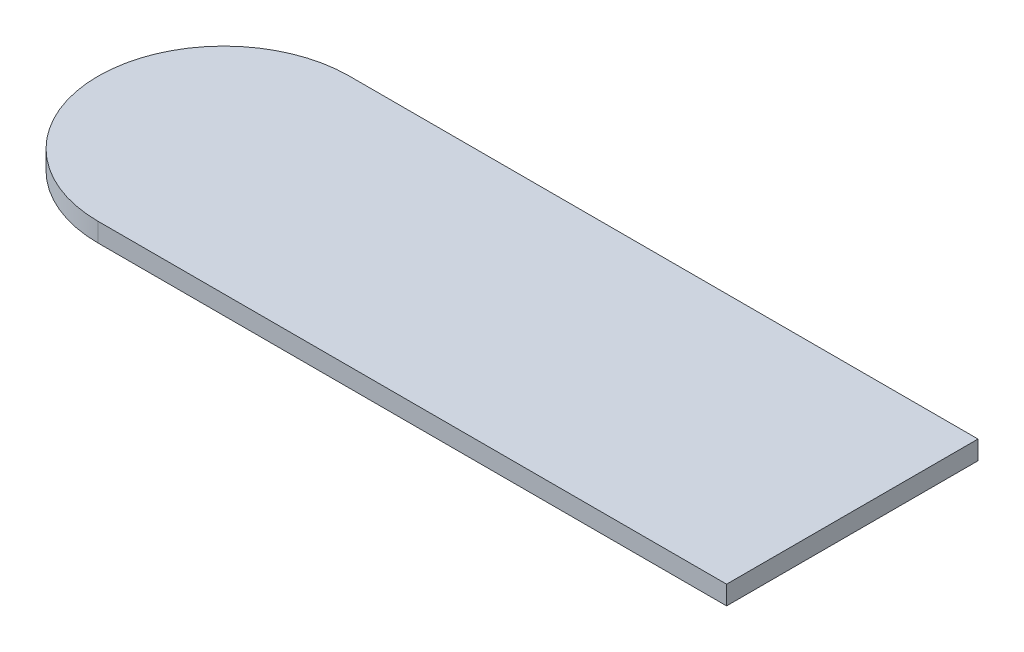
ISO-10303-21;
HEADER;
FILE_DESCRIPTION(('STEP AP214'),'2;1');
FILE_NAME('part.step','',(''),(''),'','','');
FILE_SCHEMA(('AUTOMOTIVE_DESIGN { 1 0 10303 214 1 1 1 1 }'));
ENDSEC;
DATA;
#1=APPLICATION_CONTEXT('core data for automotive mechanical design processes');
#2=APPLICATION_PROTOCOL_DEFINITION('international standard','automotive_design',2000,#1);
#3=PRODUCT_CONTEXT('',#1,'mechanical');
#4=PRODUCT('Part','Part','',(#3));
#5=PRODUCT_RELATED_PRODUCT_CATEGORY('part','',(#4));
#6=PRODUCT_DEFINITION_FORMATION('','',#4);
#7=PRODUCT_DEFINITION_CONTEXT('part definition',#1,'design');
#8=PRODUCT_DEFINITION('design','',#6,#7);
#9=PRODUCT_DEFINITION_SHAPE('','',#8);
#10=(LENGTH_UNIT() NAMED_UNIT(*) SI_UNIT(.MILLI.,.METRE.));
#11=(NAMED_UNIT(*) PLANE_ANGLE_UNIT() SI_UNIT($,.RADIAN.));
#12=(NAMED_UNIT(*) SI_UNIT($,.STERADIAN.) SOLID_ANGLE_UNIT());
#13=UNCERTAINTY_MEASURE_WITH_UNIT(LENGTH_MEASURE(1.E-05),#10,'distance_accuracy_value','');
#14=(GEOMETRIC_REPRESENTATION_CONTEXT(3) GLOBAL_UNCERTAINTY_ASSIGNED_CONTEXT((#13)) GLOBAL_UNIT_ASSIGNED_CONTEXT((#10,
#11,#12)) REPRESENTATION_CONTEXT('',''));
#15=CARTESIAN_POINT('',(0.,0.,0.));
#16=DIRECTION('',(0.,0.,1.));
#17=DIRECTION('',(1.,0.,0.));
#18=AXIS2_PLACEMENT_3D('',#15,#16,#17);
#19=CARTESIAN_POINT('',(0.,3.,20.));
#20=DIRECTION('',(0.,-1.,0.));
#21=DIRECTION('',(1.,0.,0.));
#22=AXIS2_PLACEMENT_3D('',#19,#20,#21);
#23=PLANE('',#22);
#24=DIRECTION('',(-1.,0.,0.));
#25=VECTOR('',#24,1.);
#26=CARTESIAN_POINT('',(0.,3.,-20.));
#27=LINE('',#26,#25);
#28=CARTESIAN_POINT('',(0.,3.,-20.));
#29=VERTEX_POINT('',#28);
#30=CARTESIAN_POINT('',(-100.,2.99999999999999,-20.));
#31=VERTEX_POINT('',#30);
#32=EDGE_CURVE('E107',#29,#31,#27,.T.);
#33=ORIENTED_EDGE('',*,*,#32,.T.);
#34=CARTESIAN_POINT('',(-100.,2.99999999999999,0.));
#35=DIRECTION('',(0.,-1.,0.));
#36=DIRECTION('',(1.,0.,0.));
#37=AXIS2_PLACEMENT_3D('',#34,#35,#36);
#38=CIRCLE('',#37,20.);
#39=CARTESIAN_POINT('',(-120.,2.99999999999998,0.));
#40=VERTEX_POINT('',#39);
#41=EDGE_CURVE('E117',#31,#40,#38,.F.);
#42=ORIENTED_EDGE('',*,*,#41,.T.);
#43=CARTESIAN_POINT('',(-100.,2.99999999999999,0.));
#44=DIRECTION('',(0.,-1.,0.));
#45=DIRECTION('',(1.,0.,0.));
#46=AXIS2_PLACEMENT_3D('',#43,#44,#45);
#47=CIRCLE('',#46,20.);
#48=CARTESIAN_POINT('',(-100.,2.99999999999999,20.));
#49=VERTEX_POINT('',#48);
#50=EDGE_CURVE('E115',#40,#49,#47,.F.);
#51=ORIENTED_EDGE('',*,*,#50,.T.);
#52=DIRECTION('',(-1.,0.,0.));
#53=VECTOR('',#52,1.);
#54=CARTESIAN_POINT('',(0.,3.,20.));
#55=LINE('',#54,#53);
#56=CARTESIAN_POINT('',(0.,3.,20.));
#57=VERTEX_POINT('',#56);
#58=EDGE_CURVE('E99',#57,#49,#55,.T.);
#59=ORIENTED_EDGE('',*,*,#58,.F.);
#60=DIRECTION('',(0.,0.,-1.));
#61=VECTOR('',#60,1.);
#62=CARTESIAN_POINT('',(0.,3.,20.));
#63=LINE('',#62,#61);
#64=EDGE_CURVE('E94',#57,#29,#63,.T.);
#65=ORIENTED_EDGE('',*,*,#64,.T.);
#66=EDGE_LOOP('',(#33,#42,#51,#59,#65));
#67=FACE_BOUND('',#66,.T.);
#68=ADVANCED_FACE('F38',(#67),#23,.F.);
#69=CARTESIAN_POINT('',(0.,0.,20.));
#70=DIRECTION('',(0.,-1.,0.));
#71=DIRECTION('',(1.,0.,0.));
#72=AXIS2_PLACEMENT_3D('',#69,#70,#71);
#73=PLANE('',#72);
#74=CARTESIAN_POINT('',(-100.,0.,0.));
#75=DIRECTION('',(0.,-1.,0.));
#76=DIRECTION('',(1.,0.,0.));
#77=AXIS2_PLACEMENT_3D('',#74,#75,#76);
#78=CIRCLE('',#77,20.);
#79=CARTESIAN_POINT('',(-100.,0.,20.));
#80=VERTEX_POINT('',#79);
#81=CARTESIAN_POINT('',(-120.,0.,0.));
#82=VERTEX_POINT('',#81);
#83=EDGE_CURVE('E54',#80,#82,#78,.T.);
#84=ORIENTED_EDGE('',*,*,#83,.T.);
#85=CARTESIAN_POINT('',(-100.,0.,0.));
#86=DIRECTION('',(0.,-1.,0.));
#87=DIRECTION('',(1.,0.,0.));
#88=AXIS2_PLACEMENT_3D('',#85,#86,#87);
#89=CIRCLE('',#88,20.);
#90=CARTESIAN_POINT('',(-100.,0.,-20.));
#91=VERTEX_POINT('',#90);
#92=EDGE_CURVE('E47',#82,#91,#89,.T.);
#93=ORIENTED_EDGE('',*,*,#92,.T.);
#94=DIRECTION('',(-1.,0.,0.));
#95=VECTOR('',#94,1.);
#96=CARTESIAN_POINT('',(0.,0.,-20.));
#97=LINE('',#96,#95);
#98=CARTESIAN_POINT('',(0.,0.,-20.));
#99=VERTEX_POINT('',#98);
#100=EDGE_CURVE('E88',#99,#91,#97,.T.);
#101=ORIENTED_EDGE('',*,*,#100,.F.);
#102=DIRECTION('',(0.,0.,-1.));
#103=VECTOR('',#102,1.);
#104=CARTESIAN_POINT('',(0.,0.,20.));
#105=LINE('',#104,#103);
#106=CARTESIAN_POINT('',(0.,0.,20.));
#107=VERTEX_POINT('',#106);
#108=EDGE_CURVE('E84',#107,#99,#105,.T.);
#109=ORIENTED_EDGE('',*,*,#108,.F.);
#110=DIRECTION('',(-1.,0.,0.));
#111=VECTOR('',#110,1.);
#112=CARTESIAN_POINT('',(0.,0.,20.));
#113=LINE('',#112,#111);
#114=EDGE_CURVE('E86',#107,#80,#113,.T.);
#115=ORIENTED_EDGE('',*,*,#114,.T.);
#116=EDGE_LOOP('',(#84,#93,#101,#109,#115));
#117=FACE_BOUND('',#116,.T.);
#118=ADVANCED_FACE('F85',(#117),#73,.T.);
#119=CARTESIAN_POINT('',(0.,3.,20.));
#120=DIRECTION('',(1.,0.,0.));
#121=DIRECTION('',(0.,1.,0.));
#122=AXIS2_PLACEMENT_3D('',#119,#120,#121);
#123=PLANE('',#122);
#124=DIRECTION('',(0.,-1.,0.));
#125=VECTOR('',#124,1.);
#126=CARTESIAN_POINT('',(0.,3.,-20.));
#127=LINE('',#126,#125);
#128=EDGE_CURVE('E111',#29,#99,#127,.T.);
#129=ORIENTED_EDGE('',*,*,#128,.F.);
#130=ORIENTED_EDGE('',*,*,#64,.F.);
#131=DIRECTION('',(0.,-1.,0.));
#132=VECTOR('',#131,1.);
#133=CARTESIAN_POINT('',(0.,3.,20.));
#134=LINE('',#133,#132);
#135=EDGE_CURVE('E98',#57,#107,#134,.T.);
#136=ORIENTED_EDGE('',*,*,#135,.T.);
#137=ORIENTED_EDGE('',*,*,#108,.T.);
#138=EDGE_LOOP('',(#129,#130,#136,#137));
#139=FACE_BOUND('',#138,.T.);
#140=ADVANCED_FACE('F101',(#139),#123,.T.);
#141=CARTESIAN_POINT('',(0.,0.,20.));
#142=DIRECTION('',(0.,0.,-1.));
#143=DIRECTION('',(-1.,0.,0.));
#144=AXIS2_PLACEMENT_3D('',#141,#142,#143);
#145=PLANE('',#144);
#146=ORIENTED_EDGE('',*,*,#58,.T.);
#147=DIRECTION('',(0.,1.,0.));
#148=VECTOR('',#147,1.);
#149=CARTESIAN_POINT('',(-100.,0.,20.));
#150=LINE('',#149,#148);
#151=EDGE_CURVE('E11',#49,#80,#150,.F.);
#152=ORIENTED_EDGE('',*,*,#151,.T.);
#153=ORIENTED_EDGE('',*,*,#114,.F.);
#154=ORIENTED_EDGE('',*,*,#135,.F.);
#155=EDGE_LOOP('',(#146,#152,#153,#154));
#156=FACE_BOUND('',#155,.T.);
#157=ADVANCED_FACE('F97',(#156),#145,.F.);
#158=CARTESIAN_POINT('',(0.,0.,-20.));
#159=DIRECTION('',(0.,0.,-1.));
#160=DIRECTION('',(-1.,0.,0.));
#161=AXIS2_PLACEMENT_3D('',#158,#159,#160);
#162=PLANE('',#161);
#163=ORIENTED_EDGE('',*,*,#100,.T.);
#164=DIRECTION('',(0.,1.,0.));
#165=VECTOR('',#164,1.);
#166=CARTESIAN_POINT('',(-100.,0.,-20.));
#167=LINE('',#166,#165);
#168=EDGE_CURVE('E93',#91,#31,#167,.T.);
#169=ORIENTED_EDGE('',*,*,#168,.T.);
#170=ORIENTED_EDGE('',*,*,#32,.F.);
#171=ORIENTED_EDGE('',*,*,#128,.T.);
#172=EDGE_LOOP('',(#163,#169,#170,#171));
#173=FACE_BOUND('',#172,.T.);
#174=ADVANCED_FACE('F125',(#173),#162,.T.);
#175=CARTESIAN_POINT('',(-100.,0.,0.));
#176=DIRECTION('',(0.,-1.,0.));
#177=DIRECTION('',(0.,0.,-1.));
#178=AXIS2_PLACEMENT_3D('',#175,#176,#177);
#179=CYLINDRICAL_SURFACE('',#178,20.);
#180=DIRECTION('',(0.,1.,0.));
#181=VECTOR('',#180,1.);
#182=CARTESIAN_POINT('',(-120.,2.99999999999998,0.));
#183=LINE('',#182,#181);
#184=EDGE_CURVE('E42',#82,#40,#183,.T.);
#185=ORIENTED_EDGE('',*,*,#184,.F.);
#186=ORIENTED_EDGE('',*,*,#83,.F.);
#187=ORIENTED_EDGE('',*,*,#151,.F.);
#188=ORIENTED_EDGE('',*,*,#50,.F.);
#189=EDGE_LOOP('',(#185,#186,#187,#188));
#190=FACE_BOUND('',#189,.T.);
#191=ADVANCED_FACE('F40',(#190),#179,.T.);
#192=CARTESIAN_POINT('',(-100.,0.,0.));
#193=DIRECTION('',(0.,1.,0.));
#194=DIRECTION('',(0.,0.,1.));
#195=AXIS2_PLACEMENT_3D('',#192,#193,#194);
#196=CYLINDRICAL_SURFACE('',#195,20.);
#197=ORIENTED_EDGE('',*,*,#92,.F.);
#198=ORIENTED_EDGE('',*,*,#184,.T.);
#199=ORIENTED_EDGE('',*,*,#41,.F.);
#200=ORIENTED_EDGE('',*,*,#168,.F.);
#201=EDGE_LOOP('',(#197,#198,#199,#200));
#202=FACE_BOUND('',#201,.T.);
#203=ADVANCED_FACE('F127',(#202),#196,.T.);
#204=CLOSED_SHELL('',(#68,#118,#140,#157,#174,#191,#203));
#205=MANIFOLD_SOLID_BREP('B2',#204);
#206=ADVANCED_BREP_SHAPE_REPRESENTATION('',(#18,#205),#14);
#207=SHAPE_DEFINITION_REPRESENTATION(#9,#206);
ENDSEC;
END-ISO-10303-21;
